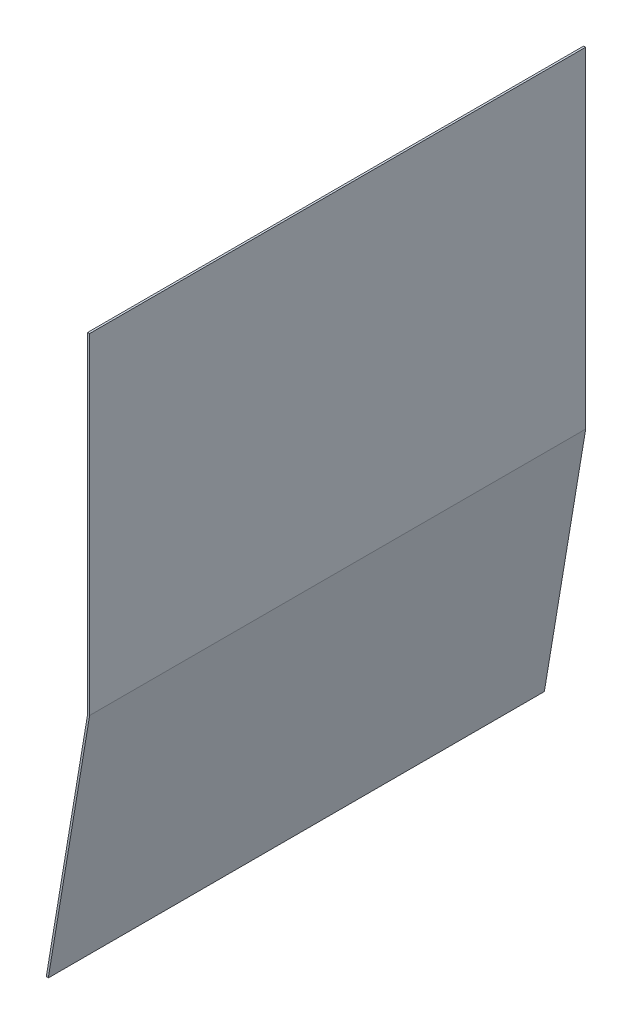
ISO-10303-21;
HEADER;
FILE_DESCRIPTION(('STEP AP214'),'2;1');
FILE_NAME('part.step','',(''),(''),'','','');
FILE_SCHEMA(('AUTOMOTIVE_DESIGN { 1 0 10303 214 1 1 1 1 }'));
ENDSEC;
DATA;
#1=APPLICATION_CONTEXT('core data for automotive mechanical design processes');
#2=APPLICATION_PROTOCOL_DEFINITION('international standard','automotive_design',2000,#1);
#3=PRODUCT_CONTEXT('',#1,'mechanical');
#4=PRODUCT('Part','Part','',(#3));
#5=PRODUCT_RELATED_PRODUCT_CATEGORY('part','',(#4));
#6=PRODUCT_DEFINITION_FORMATION('','',#4);
#7=PRODUCT_DEFINITION_CONTEXT('part definition',#1,'design');
#8=PRODUCT_DEFINITION('design','',#6,#7);
#9=PRODUCT_DEFINITION_SHAPE('','',#8);
#10=(LENGTH_UNIT() NAMED_UNIT(*) SI_UNIT(.MILLI.,.METRE.));
#11=(NAMED_UNIT(*) PLANE_ANGLE_UNIT() SI_UNIT($,.RADIAN.));
#12=(NAMED_UNIT(*) SI_UNIT($,.STERADIAN.) SOLID_ANGLE_UNIT());
#13=UNCERTAINTY_MEASURE_WITH_UNIT(LENGTH_MEASURE(1.E-05),#10,'distance_accuracy_value','');
#14=(GEOMETRIC_REPRESENTATION_CONTEXT(3) GLOBAL_UNCERTAINTY_ASSIGNED_CONTEXT((#13)) GLOBAL_UNIT_ASSIGNED_CONTEXT((#10,
#11,#12)) REPRESENTATION_CONTEXT('',''));
#15=CARTESIAN_POINT('',(0.,0.,0.));
#16=DIRECTION('',(0.,0.,1.));
#17=DIRECTION('',(1.,0.,0.));
#18=AXIS2_PLACEMENT_3D('',#15,#16,#17);
#19=CARTESIAN_POINT('',(-1.19748222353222,-199.800419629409,300.));
#20=DIRECTION('',(0.986393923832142,-0.164398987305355,0.));
#21=DIRECTION('',(0.164398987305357,0.986393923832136,0.));
#22=AXIS2_PLACEMENT_3D('',#19,#20,#21);
#23=PLANE('',#22);
#24=DIRECTION('',(-0.164398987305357,-0.986393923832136,0.));
#25=VECTOR('',#24,1.);
#26=CARTESIAN_POINT('',(-1.19748222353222,-199.800419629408,1.66533453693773E-13));
#27=LINE('',#26,#25);
#28=CARTESIAN_POINT('',(-1.21399999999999,-199.899526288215,1.66533453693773E-13));
#29=VERTEX_POINT('',#28);
#30=CARTESIAN_POINT('',(-26.197482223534,-349.800419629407,-6.93889390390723E-13));
#31=VERTEX_POINT('',#30);
#32=EDGE_CURVE('E108',#29,#31,#27,.T.);
#33=ORIENTED_EDGE('',*,*,#32,.T.);
#34=DIRECTION('',(0.,0.,-1.));
#35=VECTOR('',#34,1.);
#36=CARTESIAN_POINT('',(-26.1974822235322,-349.800419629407,300.));
#37=LINE('',#36,#35);
#38=CARTESIAN_POINT('',(-26.1974822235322,-349.800419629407,300.));
#39=VERTEX_POINT('',#38);
#40=EDGE_CURVE('E11',#39,#31,#37,.T.);
#41=ORIENTED_EDGE('',*,*,#40,.F.);
#42=DIRECTION('',(-0.164398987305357,-0.986393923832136,0.));
#43=VECTOR('',#42,1.);
#44=CARTESIAN_POINT('',(-1.19748222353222,-199.800419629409,300.));
#45=LINE('',#44,#43);
#46=CARTESIAN_POINT('',(-1.21399999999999,-199.899526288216,300.));
#47=VERTEX_POINT('',#46);
#48=EDGE_CURVE('E73',#47,#39,#45,.T.);
#49=ORIENTED_EDGE('',*,*,#48,.F.);
#50=DIRECTION('',(0.,0.,-1.));
#51=VECTOR('',#50,1.);
#52=CARTESIAN_POINT('',(-1.21399999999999,-199.899526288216,300.));
#53=LINE('',#52,#51);
#54=EDGE_CURVE('E104',#47,#29,#53,.T.);
#55=ORIENTED_EDGE('',*,*,#54,.T.);
#56=EDGE_LOOP('',(#33,#41,#49,#55));
#57=FACE_BOUND('',#56,.T.);
#58=ADVANCED_FACE('F27',(#57),#23,.F.);
#59=CARTESIAN_POINT('',(-25.,-349.999999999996,300.));
#60=DIRECTION('',(-0.164398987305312,-0.986393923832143,0.));
#61=DIRECTION('',(0.98639392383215,-0.16439898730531,0.));
#62=AXIS2_PLACEMENT_3D('',#59,#60,#61);
#63=PLANE('',#62);
#64=DIRECTION('',(-0.98639392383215,0.16439898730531,0.));
#65=VECTOR('',#64,1.);
#66=CARTESIAN_POINT('',(-25.0000000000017,-349.999999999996,-8.60422844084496E-13));
#67=LINE('',#66,#65);
#68=CARTESIAN_POINT('',(-25.0000000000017,-349.999999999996,-8.60422844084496E-13));
#69=VERTEX_POINT('',#68);
#70=EDGE_CURVE('E111',#69,#31,#67,.T.);
#71=ORIENTED_EDGE('',*,*,#70,.F.);
#72=DIRECTION('',(0.,0.,-1.));
#73=VECTOR('',#72,1.);
#74=CARTESIAN_POINT('',(-25.,-349.999999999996,300.));
#75=LINE('',#74,#73);
#76=CARTESIAN_POINT('',(-25.,-349.999999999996,300.));
#77=VERTEX_POINT('',#76);
#78=EDGE_CURVE('E35',#77,#69,#75,.T.);
#79=ORIENTED_EDGE('',*,*,#78,.F.);
#80=DIRECTION('',(-0.98639392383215,0.16439898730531,0.));
#81=VECTOR('',#80,1.);
#82=CARTESIAN_POINT('',(-25.,-349.999999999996,300.));
#83=LINE('',#82,#81);
#84=EDGE_CURVE('E181',#77,#39,#83,.T.);
#85=ORIENTED_EDGE('',*,*,#84,.T.);
#86=ORIENTED_EDGE('',*,*,#40,.T.);
#87=EDGE_LOOP('',(#71,#79,#85,#86));
#88=FACE_BOUND('',#87,.T.);
#89=ADVANCED_FACE('F129',(#88),#63,.T.);
#90=CARTESIAN_POINT('',(0.,-199.999999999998,300.));
#91=DIRECTION('',(0.986393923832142,-0.164398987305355,0.));
#92=DIRECTION('',(0.164398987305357,0.986393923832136,0.));
#93=AXIS2_PLACEMENT_3D('',#90,#91,#92);
#94=PLANE('',#93);
#95=DIRECTION('',(-0.164398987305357,-0.986393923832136,0.));
#96=VECTOR('',#95,1.);
#97=CARTESIAN_POINT('',(0.,-199.999999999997,0.));
#98=LINE('',#97,#96);
#99=CARTESIAN_POINT('',(0.,-199.999999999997,0.));
#100=VERTEX_POINT('',#99);
#101=EDGE_CURVE('E114',#100,#69,#98,.T.);
#102=ORIENTED_EDGE('',*,*,#101,.F.);
#103=DIRECTION('',(0.,0.,-1.));
#104=VECTOR('',#103,1.);
#105=CARTESIAN_POINT('',(0.,-199.999999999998,300.));
#106=LINE('',#105,#104);
#107=CARTESIAN_POINT('',(0.,-199.999999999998,300.));
#108=VERTEX_POINT('',#107);
#109=EDGE_CURVE('E94',#108,#100,#106,.T.);
#110=ORIENTED_EDGE('',*,*,#109,.F.);
#111=DIRECTION('',(-0.164398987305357,-0.986393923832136,0.));
#112=VECTOR('',#111,1.);
#113=CARTESIAN_POINT('',(0.,-199.999999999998,300.));
#114=LINE('',#113,#112);
#115=EDGE_CURVE('E100',#108,#77,#114,.T.);
#116=ORIENTED_EDGE('',*,*,#115,.T.);
#117=ORIENTED_EDGE('',*,*,#78,.T.);
#118=EDGE_LOOP('',(#102,#110,#116,#117));
#119=FACE_BOUND('',#118,.T.);
#120=ADVANCED_FACE('F126',(#119),#94,.T.);
#121=CARTESIAN_POINT('',(0.,1.72084568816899E-12,300.));
#122=DIRECTION('',(0.999999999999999,0.,0.));
#123=DIRECTION('',(0.,0.999999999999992,0.));
#124=AXIS2_PLACEMENT_3D('',#121,#122,#123);
#125=PLANE('',#124);
#126=DIRECTION('',(0.,-0.999999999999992,0.));
#127=VECTOR('',#126,1.);
#128=CARTESIAN_POINT('',(-1.72084568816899E-12,0.,1.66533453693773E-13));
#129=LINE('',#128,#127);
#130=CARTESIAN_POINT('',(-1.72084568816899E-12,0.,1.66533453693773E-13));
#131=VERTEX_POINT('',#130);
#132=EDGE_CURVE('E89',#131,#100,#129,.T.);
#133=ORIENTED_EDGE('',*,*,#132,.F.);
#134=DIRECTION('',(0.,0.,-1.));
#135=VECTOR('',#134,1.);
#136=CARTESIAN_POINT('',(0.,1.72084568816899E-12,300.));
#137=LINE('',#136,#135);
#138=CARTESIAN_POINT('',(0.,1.72084568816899E-12,300.));
#139=VERTEX_POINT('',#138);
#140=EDGE_CURVE('E84',#139,#131,#137,.T.);
#141=ORIENTED_EDGE('',*,*,#140,.F.);
#142=DIRECTION('',(0.,-0.999999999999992,0.));
#143=VECTOR('',#142,1.);
#144=CARTESIAN_POINT('',(0.,1.72084568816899E-12,300.));
#145=LINE('',#144,#143);
#146=EDGE_CURVE('E87',#139,#108,#145,.T.);
#147=ORIENTED_EDGE('',*,*,#146,.T.);
#148=ORIENTED_EDGE('',*,*,#109,.T.);
#149=EDGE_LOOP('',(#133,#141,#147,#148));
#150=FACE_BOUND('',#149,.T.);
#151=ADVANCED_FACE('F86',(#150),#125,.T.);
#152=CARTESIAN_POINT('',(-1.21399999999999,1.72084568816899E-12,300.));
#153=DIRECTION('',(0.,0.999999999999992,0.));
#154=DIRECTION('',(-0.999999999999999,0.,0.));
#155=AXIS2_PLACEMENT_3D('',#152,#153,#154);
#156=PLANE('',#155);
#157=DIRECTION('',(0.999999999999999,0.,0.));
#158=VECTOR('',#157,1.);
#159=CARTESIAN_POINT('',(-1.21400000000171,0.,1.66533453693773E-13));
#160=LINE('',#159,#158);
#161=CARTESIAN_POINT('',(-1.21400000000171,0.,1.66533453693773E-13));
#162=VERTEX_POINT('',#161);
#163=EDGE_CURVE('E118',#162,#131,#160,.T.);
#164=ORIENTED_EDGE('',*,*,#163,.F.);
#165=DIRECTION('',(0.,0.,-1.));
#166=VECTOR('',#165,1.);
#167=CARTESIAN_POINT('',(-1.21399999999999,1.72084568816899E-12,300.));
#168=LINE('',#167,#166);
#169=CARTESIAN_POINT('',(-1.21399999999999,1.72084568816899E-12,300.));
#170=VERTEX_POINT('',#169);
#171=EDGE_CURVE('E64',#170,#162,#168,.T.);
#172=ORIENTED_EDGE('',*,*,#171,.F.);
#173=DIRECTION('',(0.999999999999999,0.,0.));
#174=VECTOR('',#173,1.);
#175=CARTESIAN_POINT('',(-1.21399999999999,1.72084568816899E-12,300.));
#176=LINE('',#175,#174);
#177=EDGE_CURVE('E98',#170,#139,#176,.T.);
#178=ORIENTED_EDGE('',*,*,#177,.T.);
#179=ORIENTED_EDGE('',*,*,#140,.T.);
#180=EDGE_LOOP('',(#164,#172,#178,#179));
#181=FACE_BOUND('',#180,.T.);
#182=ADVANCED_FACE('F102',(#181),#156,.T.);
#183=CARTESIAN_POINT('',(-1.21399999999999,1.72084568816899E-12,300.));
#184=DIRECTION('',(0.999999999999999,0.,0.));
#185=DIRECTION('',(0.,0.999999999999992,0.));
#186=AXIS2_PLACEMENT_3D('',#183,#184,#185);
#187=PLANE('',#186);
#188=DIRECTION('',(0.,-0.999999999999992,0.));
#189=VECTOR('',#188,1.);
#190=CARTESIAN_POINT('',(-1.21400000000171,0.,1.66533453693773E-13));
#191=LINE('',#190,#189);
#192=EDGE_CURVE('E67',#162,#29,#191,.T.);
#193=ORIENTED_EDGE('',*,*,#192,.T.);
#194=ORIENTED_EDGE('',*,*,#54,.F.);
#195=DIRECTION('',(0.,-0.999999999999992,0.));
#196=VECTOR('',#195,1.);
#197=CARTESIAN_POINT('',(-1.21399999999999,1.72084568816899E-12,300.));
#198=LINE('',#197,#196);
#199=EDGE_CURVE('E43',#170,#47,#198,.T.);
#200=ORIENTED_EDGE('',*,*,#199,.F.);
#201=ORIENTED_EDGE('',*,*,#171,.T.);
#202=EDGE_LOOP('',(#193,#194,#200,#201));
#203=FACE_BOUND('',#202,.T.);
#204=ADVANCED_FACE('F134',(#203),#187,.F.);
#205=CARTESIAN_POINT('',(-26.1974822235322,-349.800419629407,300.));
#206=DIRECTION('',(0.,0.,-1.));
#207=DIRECTION('',(-0.999999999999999,0.,0.));
#208=AXIS2_PLACEMENT_3D('',#205,#206,#207);
#209=PLANE('',#208);
#210=ORIENTED_EDGE('',*,*,#48,.T.);
#211=ORIENTED_EDGE('',*,*,#84,.F.);
#212=ORIENTED_EDGE('',*,*,#115,.F.);
#213=ORIENTED_EDGE('',*,*,#146,.F.);
#214=ORIENTED_EDGE('',*,*,#177,.F.);
#215=ORIENTED_EDGE('',*,*,#199,.T.);
#216=EDGE_LOOP('',(#210,#211,#212,#213,#214,#215));
#217=FACE_BOUND('',#216,.T.);
#218=ADVANCED_FACE('F97',(#217),#209,.F.);
#219=CARTESIAN_POINT('',(-26.197482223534,-349.800419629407,-6.93889390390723E-13));
#220=DIRECTION('',(0.,0.,-1.));
#221=DIRECTION('',(-0.999999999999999,0.,0.));
#222=AXIS2_PLACEMENT_3D('',#219,#220,#221);
#223=PLANE('',#222);
#224=ORIENTED_EDGE('',*,*,#32,.F.);
#225=ORIENTED_EDGE('',*,*,#192,.F.);
#226=ORIENTED_EDGE('',*,*,#163,.T.);
#227=ORIENTED_EDGE('',*,*,#132,.T.);
#228=ORIENTED_EDGE('',*,*,#101,.T.);
#229=ORIENTED_EDGE('',*,*,#70,.T.);
#230=EDGE_LOOP('',(#224,#225,#226,#227,#228,#229));
#231=FACE_BOUND('',#230,.T.);
#232=ADVANCED_FACE('F132',(#231),#223,.T.);
#233=CLOSED_SHELL('',(#58,#89,#120,#151,#182,#204,#218,#232));
#234=MANIFOLD_SOLID_BREP('B2',#233);
#235=ADVANCED_BREP_SHAPE_REPRESENTATION('',(#18,#234),#14);
#236=SHAPE_DEFINITION_REPRESENTATION(#9,#235);
ENDSEC;
END-ISO-10303-21;
